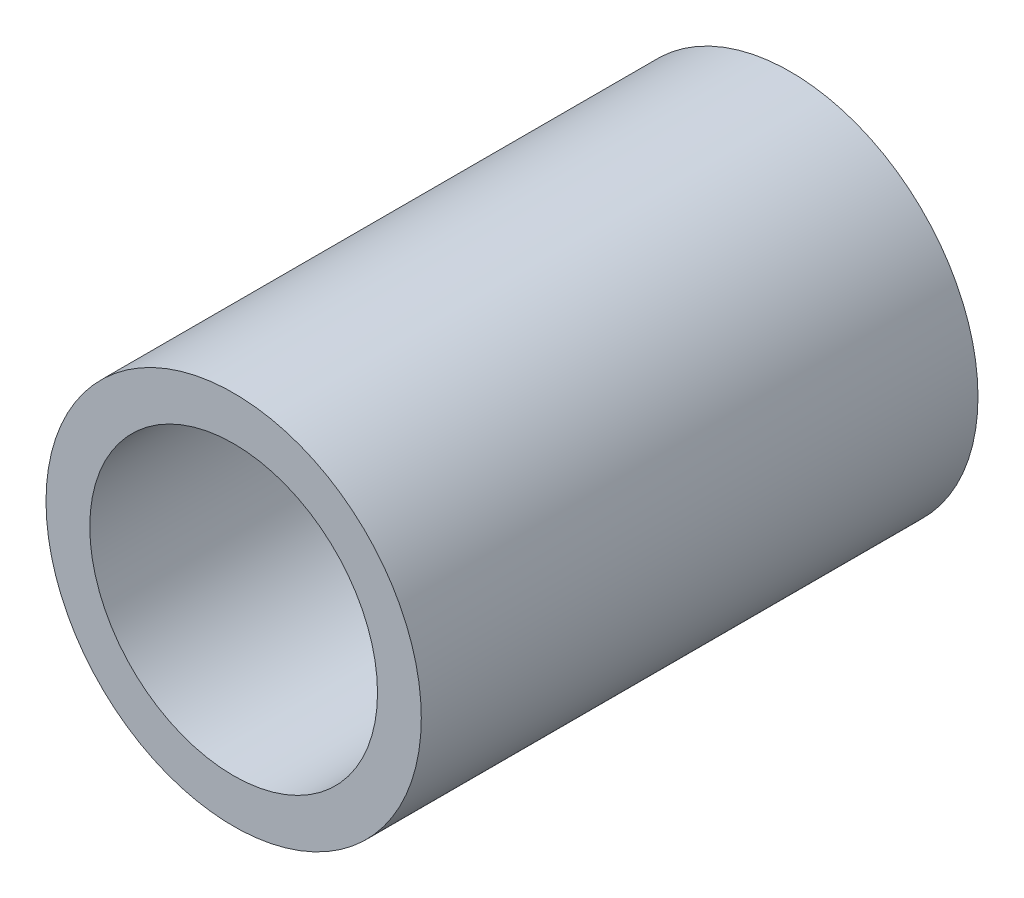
ISO-10303-21;
HEADER;
FILE_DESCRIPTION(('STEP AP214'),'2;1');
FILE_NAME('part.step','',(''),(''),'','','');
FILE_SCHEMA(('AUTOMOTIVE_DESIGN { 1 0 10303 214 1 1 1 1 }'));
ENDSEC;
DATA;
#1=APPLICATION_CONTEXT('core data for automotive mechanical design processes');
#2=APPLICATION_PROTOCOL_DEFINITION('international standard','automotive_design',2000,#1);
#3=PRODUCT_CONTEXT('',#1,'mechanical');
#4=PRODUCT('Part','Part','',(#3));
#5=PRODUCT_RELATED_PRODUCT_CATEGORY('part','',(#4));
#6=PRODUCT_DEFINITION_FORMATION('','',#4);
#7=PRODUCT_DEFINITION_CONTEXT('part definition',#1,'design');
#8=PRODUCT_DEFINITION('design','',#6,#7);
#9=PRODUCT_DEFINITION_SHAPE('','',#8);
#10=(LENGTH_UNIT() NAMED_UNIT(*) SI_UNIT(.MILLI.,.METRE.));
#11=(NAMED_UNIT(*) PLANE_ANGLE_UNIT() SI_UNIT($,.RADIAN.));
#12=(NAMED_UNIT(*) SI_UNIT($,.STERADIAN.) SOLID_ANGLE_UNIT());
#13=UNCERTAINTY_MEASURE_WITH_UNIT(LENGTH_MEASURE(1.E-05),#10,'distance_accuracy_value','');
#14=(GEOMETRIC_REPRESENTATION_CONTEXT(3) GLOBAL_UNCERTAINTY_ASSIGNED_CONTEXT((#13)) GLOBAL_UNIT_ASSIGNED_CONTEXT((#10,
#11,#12)) REPRESENTATION_CONTEXT('',''));
#15=CARTESIAN_POINT('',(0.,0.,0.));
#16=DIRECTION('',(0.,0.,1.));
#17=DIRECTION('',(1.,0.,0.));
#18=AXIS2_PLACEMENT_3D('',#15,#16,#17);
#19=CARTESIAN_POINT('',(0.,0.,4.45));
#20=DIRECTION('',(0.,0.,1.));
#21=DIRECTION('',(1.,0.,0.));
#22=AXIS2_PLACEMENT_3D('',#19,#20,#21);
#23=PLANE('',#22);
#24=CARTESIAN_POINT('',(0.,0.,4.45));
#25=DIRECTION('',(0.,0.,1.));
#26=DIRECTION('',(1.,0.,0.));
#27=AXIS2_PLACEMENT_3D('',#24,#25,#26);
#28=CIRCLE('',#27,1.5);
#29=CARTESIAN_POINT('',(1.5,0.,4.45));
#30=VERTEX_POINT('',#29);
#31=EDGE_CURVE('E10',#30,#30,#28,.T.);
#32=ORIENTED_EDGE('',*,*,#31,.T.);
#33=EDGE_LOOP('',(#32));
#34=FACE_BOUND('',#33,.T.);
#35=CARTESIAN_POINT('',(0.,0.,4.45));
#36=DIRECTION('',(0.,0.,1.));
#37=DIRECTION('',(1.,0.,0.));
#38=AXIS2_PLACEMENT_3D('',#35,#36,#37);
#39=CIRCLE('',#38,1.15);
#40=CARTESIAN_POINT('',(1.15,0.,4.45));
#41=VERTEX_POINT('',#40);
#42=EDGE_CURVE('E39',#41,#41,#39,.T.);
#43=ORIENTED_EDGE('',*,*,#42,.F.);
#44=EDGE_LOOP('',(#43));
#45=FACE_BOUND('',#44,.T.);
#46=ADVANCED_FACE('F28',(#34,#45),#23,.T.);
#47=CARTESIAN_POINT('',(0.,0.,0.));
#48=DIRECTION('',(0.,0.,1.));
#49=DIRECTION('',(1.,0.,0.));
#50=AXIS2_PLACEMENT_3D('',#47,#48,#49);
#51=PLANE('',#50);
#52=CARTESIAN_POINT('',(0.,0.,0.));
#53=DIRECTION('',(0.,0.,1.));
#54=DIRECTION('',(1.,0.,0.));
#55=AXIS2_PLACEMENT_3D('',#52,#53,#54);
#56=CIRCLE('',#55,1.5);
#57=CARTESIAN_POINT('',(1.5,0.,0.));
#58=VERTEX_POINT('',#57);
#59=EDGE_CURVE('E32',#58,#58,#56,.T.);
#60=ORIENTED_EDGE('',*,*,#59,.F.);
#61=EDGE_LOOP('',(#60));
#62=FACE_BOUND('',#61,.T.);
#63=CARTESIAN_POINT('',(0.,0.,0.));
#64=DIRECTION('',(0.,0.,1.));
#65=DIRECTION('',(1.,0.,0.));
#66=AXIS2_PLACEMENT_3D('',#63,#64,#65);
#67=CIRCLE('',#66,1.15);
#68=CARTESIAN_POINT('',(1.15,0.,0.));
#69=VERTEX_POINT('',#68);
#70=EDGE_CURVE('E41',#69,#69,#67,.T.);
#71=ORIENTED_EDGE('',*,*,#70,.T.);
#72=EDGE_LOOP('',(#71));
#73=FACE_BOUND('',#72,.T.);
#74=ADVANCED_FACE('F51',(#62,#73),#51,.F.);
#75=CARTESIAN_POINT('',(0.,0.,4.45));
#76=DIRECTION('',(0.,0.,-1.));
#77=DIRECTION('',(-1.,0.,0.));
#78=AXIS2_PLACEMENT_3D('',#75,#76,#77);
#79=CYLINDRICAL_SURFACE('',#78,1.5);
#80=ORIENTED_EDGE('',*,*,#31,.F.);
#81=EDGE_LOOP('',(#80));
#82=FACE_BOUND('',#81,.T.);
#83=ORIENTED_EDGE('',*,*,#59,.T.);
#84=EDGE_LOOP('',(#83));
#85=FACE_BOUND('',#84,.T.);
#86=ADVANCED_FACE('F30',(#82,#85),#79,.T.);
#87=CARTESIAN_POINT('',(0.,0.,4.45));
#88=DIRECTION('',(0.,0.,-1.));
#89=DIRECTION('',(-1.,0.,0.));
#90=AXIS2_PLACEMENT_3D('',#87,#88,#89);
#91=CYLINDRICAL_SURFACE('',#90,1.15);
#92=ORIENTED_EDGE('',*,*,#42,.T.);
#93=EDGE_LOOP('',(#92));
#94=FACE_BOUND('',#93,.T.);
#95=ORIENTED_EDGE('',*,*,#70,.F.);
#96=EDGE_LOOP('',(#95));
#97=FACE_BOUND('',#96,.T.);
#98=ADVANCED_FACE('F47',(#94,#97),#91,.F.);
#99=CLOSED_SHELL('',(#46,#74,#86,#98));
#100=MANIFOLD_SOLID_BREP('B2',#99);
#101=ADVANCED_BREP_SHAPE_REPRESENTATION('',(#18,#100),#14);
#102=SHAPE_DEFINITION_REPRESENTATION(#9,#101);
ENDSEC;
END-ISO-10303-21;
